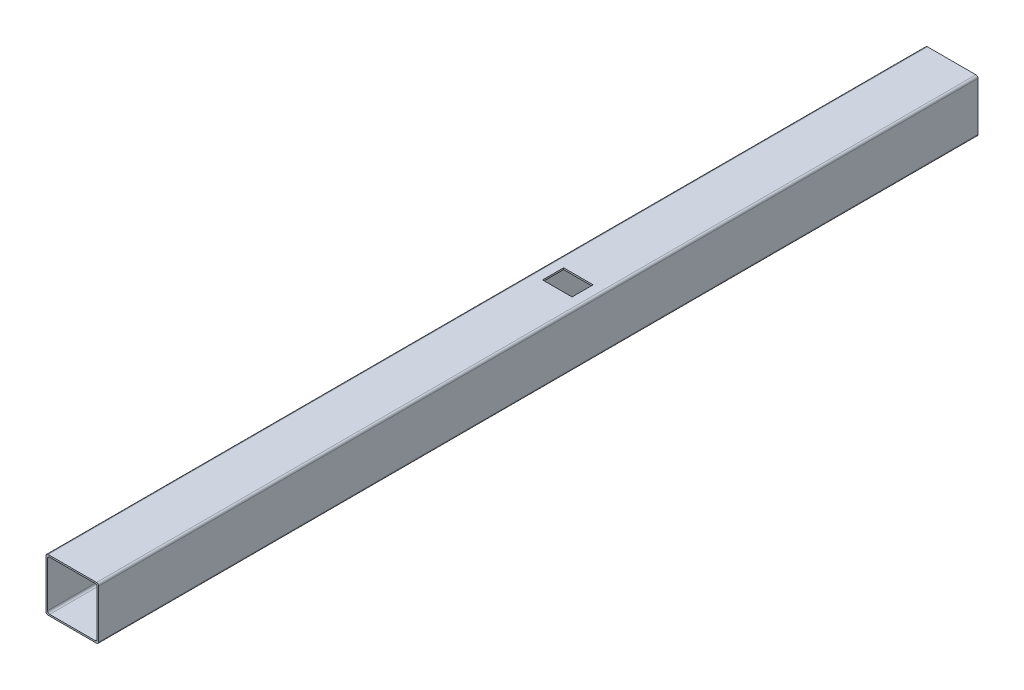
from build123d import *

# Parameters (mm, degrees)
ESQUISSE1_W             = 100
ESQUISSE1_H             = 100
ESQUISSE1_W_2           = 94
ESQUISSE1_H_2           = 94
EXTRU_MINCE1_DEPTH      = 1670
CONG_1_R                = 4
ENL_V_MAT_EXTRU_1_REACH = 1677.977
ESQUISSE2_W             = 90
ESQUISSE2_H             = 150
ESQUISSE3_W             = 56
ESQUISSE3_H             = 40
ENL_V_MAT_EXTRU_2_DEPTH = 10


with BuildPart() as part:
    # Esquisse1 → Extru.-Mince1 (new body)
    with BuildSketch(Plane.XY):
        with Locations((50, 50)):
            Rectangle(ESQUISSE1_W, ESQUISSE1_H)
        with Locations((50, 50)):
            Rectangle(ESQUISSE1_W_2, ESQUISSE1_H_2, mode=Mode.SUBTRACT)
    extrude(amount=EXTRU_MINCE1_DEPTH)

    # Cong_1
    cong_1_edges = [part.edges().sort_by_distance(p)[0] for p in [
        (3, 97, 835),
        (3, 3, 835),
        (97, 3, 835),
        (97, 97, 835),
        (0, 100, 835),
        (100, 100, 835),
        (100, 0, 835),
        (0, 0, 835),
    ]]
    fillet(cong_1_edges, radius=CONG_1_R)

    # Esquisse2 → Enl_v. mat.-Extru.1 (cut, up to next)
    with BuildSketch(Plane.XZ, mode=Mode.PRIVATE) as enl_v_mat_extru_1_sk1:
        with Locations((50, 675)):
            Rectangle(ESQUISSE2_W, ESQUISSE2_H)
    enl_v_mat_extru_1_tool1 = extrude(enl_v_mat_extru_1_sk1.sketch, amount=-ENL_V_MAT_EXTRU_1_REACH, mode=Mode.PRIVATE) & part.part
    add(enl_v_mat_extru_1_tool1.solids().sort_by_distance((50, 0, 675))[0], mode=Mode.SUBTRACT)

    # Esquisse3 → Enl_v. mat.-Extru.2 (cut)
    with BuildSketch(Plane.XZ.offset(-97)):
        with Locations((50, 729)):
            Rectangle(ESQUISSE3_W, ESQUISSE3_H)
    extrude(amount=-ENL_V_MAT_EXTRU_2_DEPTH, mode=Mode.SUBTRACT)


solid = part.part
